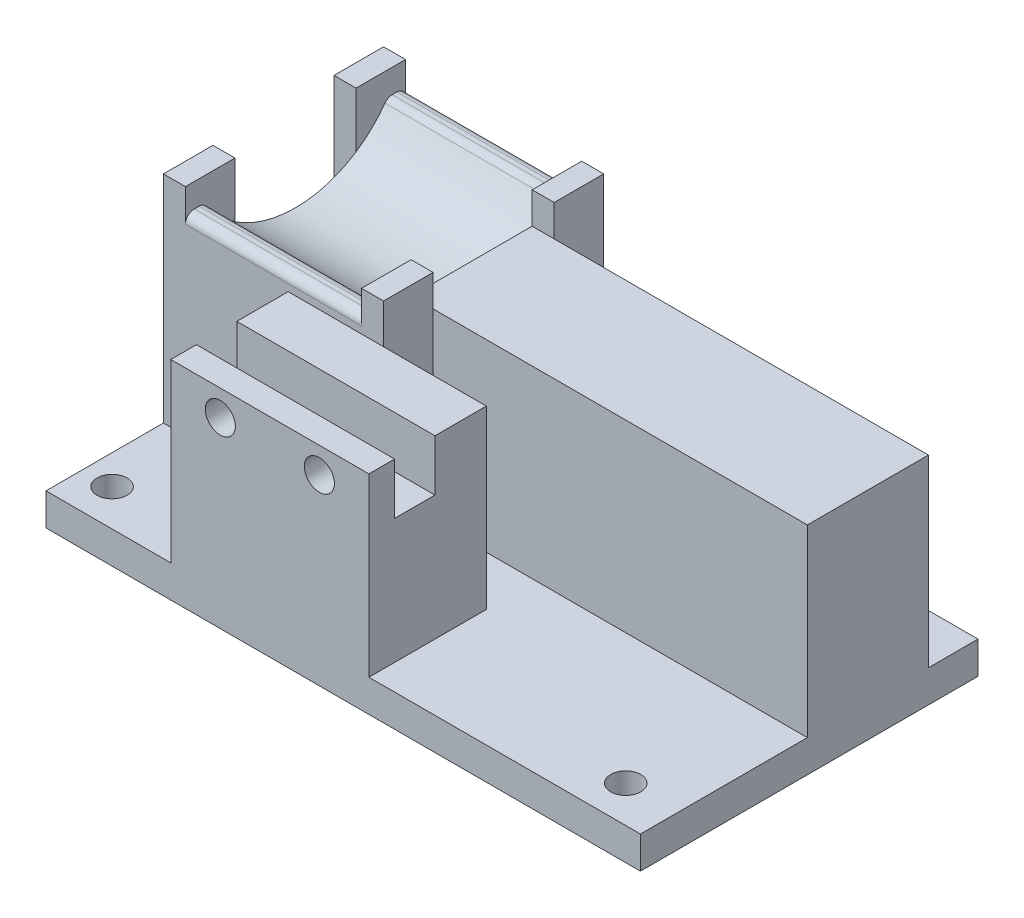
from build123d import *

# Parameters (mm, degrees)
SKETCH1_W           = 81
SKETCH1_H           = 46
BOSS_EXTRUDE1_DEPTH = 4.39
SKETCH3_W           = 30
SKETCH3_H           = 30
BOSS_EXTRUDE2_DEPTH = 34.4
CUT_EXTRUDE2_DEPTH  = 24
CUT_EXTRUDE3_START  = -30
SKETCH9_W           = 24
SKETCH9_H           = 8.243097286
CUT_EXTRUDE3_DEPTH  = 30
SKETCH11_W          = 16.5
SKETCH11_H          = 34.4
CUT_EXTRUDE4_DEPTH  = 3
SKETCH18_W          = 3
SKETCH18_H          = 6.75
CUT_EXTRUDE8_DEPTH  = 5
SKETCH12_W          = 27
SKETCH12_H          = 16
BOSS_EXTRUDE3_DEPTH = 24
SKETCH13_W          = 27
SKETCH13_H          = 5.5
CUT_EXTRUDE5_DEPTH  = 7
SKETCH14_R          = 2.05
CUT_EXTRUDE6_DEPTH  = 3.5
CUT_EXTRUDE7_REACH  = 57.078
SKETCH15_R          = 2.05
SKETCH17_W          = 54
SKETCH17_H          = 16.5
BOSS_EXTRUDE4_DEPTH = 25.1
FILLET1_R           = 1.2
FILLET2_R           = 1.2


with BuildPart() as part:
    # Sketch1 → Boss-Extrude1 (new body)
    with BuildSketch(Plane(origin=(0, 0, 0), x_dir=(1, 0, 0), z_dir=(0, 1, 0))):
        Rectangle(SKETCH1_W, SKETCH1_H)
    extrude(amount=BOSS_EXTRUDE1_DEPTH)

    # Sketch3 → Boss-Extrude2 (add)
    with BuildSketch(Plane(origin=(0, 4.39, 0), x_dir=(1, 0, 0), z_dir=(0, 1, 0))):
        with Locations((-25.5, 8)):
            Rectangle(SKETCH3_W, SKETCH3_H)
    extrude(amount=BOSS_EXTRUDE2_DEPTH)

    # Sketch7 → Cut-Extrude2 (cut)
    with BuildSketch(Plane(origin=(-13.5, 0, 0), x_dir=(0, 0, -1), z_dir=(1, 0, 0))):
        with BuildLine():
            Line((-7, 38.79), (23, 38.79))
            ThreePointArc((23, 38.79), (8, 23.79), (-7, 38.79))
        make_face()
    extrude(amount=-CUT_EXTRUDE2_DEPTH, mode=Mode.SUBTRACT)

    # Sketch9 → Cut-Extrude3 (cut)
    with BuildSketch(Plane.XY.offset(7).offset(CUT_EXTRUDE3_START)):
        with Locations((-25.5, 34.668451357)):
            Rectangle(SKETCH9_W, SKETCH9_H)
    extrude(amount=CUT_EXTRUDE3_DEPTH, mode=Mode.SUBTRACT)

    # Sketch11 → Cut-Extrude4 (cut)
    with BuildSketch(Plane(origin=(-10.5, 0, 0), x_dir=(0, 0, -1), z_dir=(1, 0, 0))):
        with Locations((8, 21.59)):
            Rectangle(SKETCH11_W, SKETCH11_H)
    cut_extrude4 = extrude(amount=-CUT_EXTRUDE4_DEPTH, mode=Mode.SUBTRACT)

    # Sketch18 → Cut-Extrude8 (cut)
    with BuildSketch(Plane(origin=(0, 38.79, 0), x_dir=(1, 0, 0), z_dir=(0, 1, 0))):
        with Locations((-12, -3.625)):
            Rectangle(SKETCH18_W, SKETCH18_H)
        with Locations((-12, 19.625)):
            Rectangle(SKETCH18_W, SKETCH18_H)
    cut_extrude8 = extrude(amount=-CUT_EXTRUDE8_DEPTH, mode=Mode.SUBTRACT)

    # Mirror3: Cut-Extrude4, Cut-Extrude8 across plane
    add(cut_extrude4.mirror(Plane(origin=(-25.5, 0, 0), x_dir=(0, 0, 1), z_dir=(1, 0, 0))), mode=Mode.SUBTRACT)
    add(cut_extrude8.mirror(Plane(origin=(-25.5, 0, 0), x_dir=(0, 0, 1), z_dir=(1, 0, 0))), mode=Mode.SUBTRACT)

    # Sketch12 → Boss-Extrude3 (add)
    with BuildSketch(Plane(origin=(0, 4.39, 0), x_dir=(1, 0, 0), z_dir=(0, 1, 0))):
        with Locations((-10, -15)):
            Rectangle(SKETCH12_W, SKETCH12_H)
    extrude(amount=BOSS_EXTRUDE3_DEPTH)

    # Sketch13 → Cut-Extrude5 (cut)
    with BuildSketch(Plane(origin=(0, 28.39, 0), x_dir=(1, 0, 0), z_dir=(0, 1, 0))):
        with Locations((-10, -16.75)):
            Rectangle(SKETCH13_W, SKETCH13_H)
    extrude(amount=-CUT_EXTRUDE5_DEPTH, mode=Mode.SUBTRACT)

    # Sketch14 → Cut-Extrude6 (cut)
    with BuildSketch(Plane.XY.offset(23)):
        with Locations((-16.75, 24.89)):
            Circle(SKETCH14_R)
        with Locations((-3.25, 24.89)):
            Circle(SKETCH14_R)
    extrude(amount=-CUT_EXTRUDE6_DEPTH, mode=Mode.SUBTRACT)

    # Sketch15 → Cut-Extrude7 (cut, up to next)
    with BuildSketch(Plane(origin=(0, 4.39, 0), x_dir=(1, 0, 0), z_dir=(0, 1, 0)), mode=Mode.PRIVATE) as cut_extrude7_sk1:
        with Locations(Location((-36.5, -18, 0), (0, 0, 270))):
            Circle(SKETCH15_R)
    cut_extrude7_tool1 = extrude(cut_extrude7_sk1.sketch, amount=-CUT_EXTRUDE7_REACH, mode=Mode.PRIVATE) & part.part
    # Sketch15 → Cut-Extrude7 (cut, up to next)
    with BuildSketch(Plane(origin=(0, 4.39, 0), x_dir=(1, 0, 0), z_dir=(0, 1, 0)), mode=Mode.PRIVATE) as cut_extrude7_sk2:
        with Locations(Location((33.5, -18, 0), (0, 0, 270))):
            Circle(SKETCH15_R)
    cut_extrude7_tool2 = extrude(cut_extrude7_sk2.sketch, amount=-CUT_EXTRUDE7_REACH, mode=Mode.PRIVATE) & part.part
    add(cut_extrude7_tool1.solids().sort_by_distance((-36.5, 4.39, 18))[0], mode=Mode.SUBTRACT)
    add(cut_extrude7_tool2.solids().sort_by_distance((33.5, 4.39, 18))[0], mode=Mode.SUBTRACT)

    # Sketch17 → Boss-Extrude4 (add)
    with BuildSketch(Plane(origin=(0, 4.39, 0), x_dir=(1, 0, 0), z_dir=(0, 1, 0))):
        with Locations((13.5, 8)):
            Rectangle(SKETCH17_W, SKETCH17_H)
    extrude(amount=BOSS_EXTRUDE4_DEPTH)

    # Fillet1
    fillet1_edges = [part.edges().sort_by_distance(p)[0] for p in [
        (-25.5, 30.546902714, -20.532012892),
        (-25.5, 30.546902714, -23),
    ]]
    fillet(fillet1_edges, radius=FILLET1_R)

    # Fillet2
    fillet2_edges = [part.edges().sort_by_distance(p)[0] for p in [
        (-25.5, 30.546902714, 4.532012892),
        (-25.5, 30.546902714, 7),
    ]]
    fillet(fillet2_edges, radius=FILLET2_R)


solid = part.part
